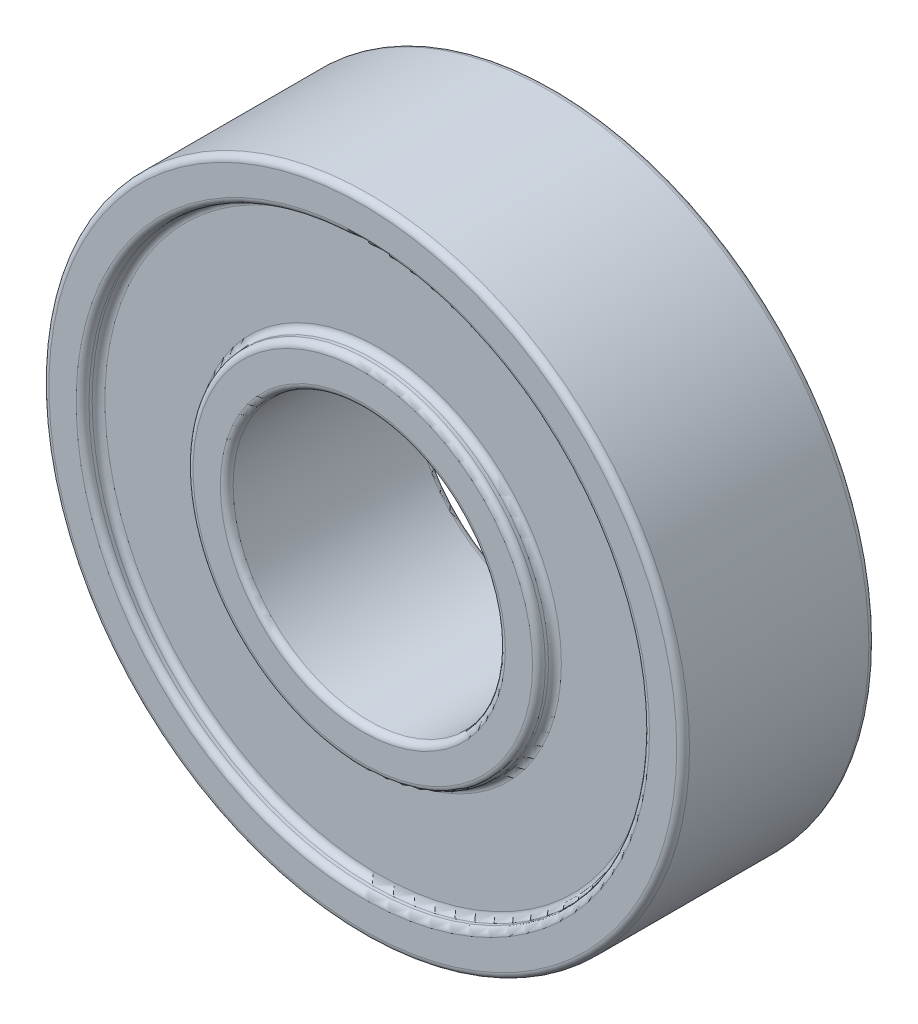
from build123d import *

# Parameters (mm, degrees)
ESQUISSE1_R             = 20
ESQUISSE1_R_2           = 8.5
BASE_EXTRUSION_DEPTH    = 12
ESQUISSE2_R             = 17.5
ESQUISSE2_R_2           = 11
ENL_V_MAT_EXTRU_1_DEPTH = 1
ENL_V_START             = -1
ESQUISSE4_R             = 17.5
ESQUISSE4_R_2           = 11
ENL_V_MAT_EXTRU_2_DEPTH = 1
CONG_1_R                = 0.4


with BuildPart() as part:
    # Esquisse1 → Base-Extrusion (new body)
    with BuildSketch(Plane.XY):
        Circle(ESQUISSE1_R)
        Circle(ESQUISSE1_R_2, mode=Mode.SUBTRACT)
    extrude(amount=BASE_EXTRUSION_DEPTH)

    # Esquisse2 → Enl_v. mat.-Extru.1 (cut)
    with BuildSketch(Plane.XY.offset(12)):
        Circle(ESQUISSE2_R)
        Circle(ESQUISSE2_R_2, mode=Mode.SUBTRACT)
    extrude(amount=-ENL_V_MAT_EXTRU_1_DEPTH, mode=Mode.SUBTRACT)

    # Esquisse4 → Enl_v. mat.-Extru.2 (cut)
    with BuildSketch(Plane(origin=(0, 0, 0), x_dir=(-1, 0, 0), z_dir=(0, 0, -1)).offset(ENL_V_START)):
        with Locations(Location((0, 0, 0), (0, 0, 180))):
            Circle(ESQUISSE4_R)
        with Locations((-0.118835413, 0.178253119)):
            Circle(ESQUISSE4_R_2, mode=Mode.SUBTRACT)
    extrude(amount=ENL_V_MAT_EXTRU_2_DEPTH, mode=Mode.SUBTRACT)

    # Cong_1
    cong_1_edges = [part.edges().sort_by_distance(p)[0] for p in [
        (-20, 0, 0),
        (-20, 0, 12),
        (-17.5, 0, 0),
        (-17.5, 0, 12),
        (-17.5, 0, 1),
        (-17.5, 0, 11),
        (11.118835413, 0.178253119, 1),
        (-11, 0, 11),
        (11.118835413, 0.178253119, 0),
        (-11, 0, 12),
        (-8.5, 0, 0),
        (-8.5, 0, 12),
    ]]
    fillet(cong_1_edges, radius=CONG_1_R)


solid = part.part
